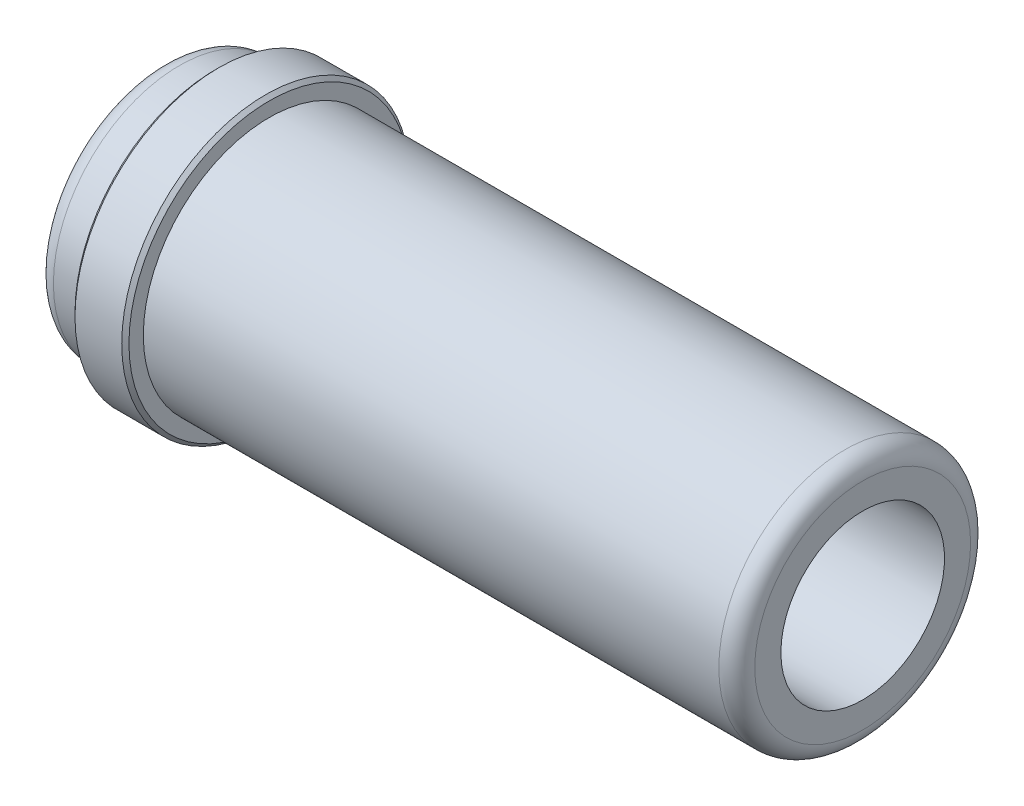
ISO-10303-21;
HEADER;
FILE_DESCRIPTION(('STEP AP214'),'2;1');
FILE_NAME('part.step','',(''),(''),'','','');
FILE_SCHEMA(('AUTOMOTIVE_DESIGN { 1 0 10303 214 1 1 1 1 }'));
ENDSEC;
DATA;
#1=APPLICATION_CONTEXT('core data for automotive mechanical design processes');
#2=APPLICATION_PROTOCOL_DEFINITION('international standard','automotive_design',2000,#1);
#3=PRODUCT_CONTEXT('',#1,'mechanical');
#4=PRODUCT('Part','Part','',(#3));
#5=PRODUCT_RELATED_PRODUCT_CATEGORY('part','',(#4));
#6=PRODUCT_DEFINITION_FORMATION('','',#4);
#7=PRODUCT_DEFINITION_CONTEXT('part definition',#1,'design');
#8=PRODUCT_DEFINITION('design','',#6,#7);
#9=PRODUCT_DEFINITION_SHAPE('','',#8);
#10=(LENGTH_UNIT() NAMED_UNIT(*) SI_UNIT(.MILLI.,.METRE.));
#11=(NAMED_UNIT(*) PLANE_ANGLE_UNIT() SI_UNIT($,.RADIAN.));
#12=(NAMED_UNIT(*) SI_UNIT($,.STERADIAN.) SOLID_ANGLE_UNIT());
#13=UNCERTAINTY_MEASURE_WITH_UNIT(LENGTH_MEASURE(1.E-05),#10,'distance_accuracy_value','');
#14=(GEOMETRIC_REPRESENTATION_CONTEXT(3) GLOBAL_UNCERTAINTY_ASSIGNED_CONTEXT((#13)) GLOBAL_UNIT_ASSIGNED_CONTEXT((#10,
#11,#12)) REPRESENTATION_CONTEXT('',''));
#15=CARTESIAN_POINT('',(0.,0.,0.));
#16=DIRECTION('',(0.,0.,1.));
#17=DIRECTION('',(1.,0.,0.));
#18=AXIS2_PLACEMENT_3D('',#15,#16,#17);
#19=CARTESIAN_POINT('',(3.,7.,0.));
#20=DIRECTION('',(1.,0.,0.));
#21=DIRECTION('',(0.,0.,-1.));
#22=AXIS2_PLACEMENT_3D('',#19,#20,#21);
#23=PLANE('',#22);
#24=CARTESIAN_POINT('',(3.,0.,0.));
#25=DIRECTION('',(1.,0.,0.));
#26=DIRECTION('',(0.,0.,-1.));
#27=AXIS2_PLACEMENT_3D('',#24,#25,#26);
#28=CIRCLE('',#27,7.8);
#29=CARTESIAN_POINT('',(3.,0.,-7.8));
#30=VERTEX_POINT('',#29);
#31=EDGE_CURVE('E9',#30,#30,#28,.F.);
#32=ORIENTED_EDGE('',*,*,#31,.T.);
#33=EDGE_LOOP('',(#32));
#34=FACE_BOUND('',#33,.T.);
#35=CARTESIAN_POINT('',(3.,0.,0.));
#36=DIRECTION('',(-1.,0.,0.));
#37=DIRECTION('',(0.,0.,1.));
#38=AXIS2_PLACEMENT_3D('',#35,#36,#37);
#39=CIRCLE('',#38,7.);
#40=CARTESIAN_POINT('',(3.,0.,7.));
#41=VERTEX_POINT('',#40);
#42=EDGE_CURVE('E55',#41,#41,#39,.T.);
#43=ORIENTED_EDGE('',*,*,#42,.F.);
#44=EDGE_LOOP('',(#43));
#45=FACE_BOUND('',#44,.T.);
#46=ADVANCED_FACE('F14',(#34,#45),#23,.F.);
#47=CARTESIAN_POINT('',(0.,0.,0.));
#48=DIRECTION('',(-1.,0.,0.));
#49=DIRECTION('',(0.,0.,1.));
#50=AXIS2_PLACEMENT_3D('',#47,#48,#49);
#51=CYLINDRICAL_SURFACE('',#50,8.);
#52=CARTESIAN_POINT('',(5.8,0.,0.));
#53=DIRECTION('',(-1.,0.,0.));
#54=DIRECTION('',(0.,0.,1.));
#55=AXIS2_PLACEMENT_3D('',#52,#53,#54);
#56=CIRCLE('',#55,8.);
#57=CARTESIAN_POINT('',(5.8,0.,8.));
#58=VERTEX_POINT('',#57);
#59=EDGE_CURVE('E25',#58,#58,#56,.T.);
#60=ORIENTED_EDGE('',*,*,#59,.T.);
#61=EDGE_LOOP('',(#60));
#62=FACE_BOUND('',#61,.T.);
#63=CARTESIAN_POINT('',(3.2,0.,0.));
#64=DIRECTION('',(1.,0.,0.));
#65=DIRECTION('',(0.,0.,-1.));
#66=AXIS2_PLACEMENT_3D('',#63,#64,#65);
#67=CIRCLE('',#66,8.);
#68=CARTESIAN_POINT('',(3.2,0.,-8.));
#69=VERTEX_POINT('',#68);
#70=EDGE_CURVE('E29',#69,#69,#67,.T.);
#71=ORIENTED_EDGE('',*,*,#70,.T.);
#72=EDGE_LOOP('',(#71));
#73=FACE_BOUND('',#72,.T.);
#74=ADVANCED_FACE('F62',(#62,#73),#51,.T.);
#75=CARTESIAN_POINT('',(6.,8.,0.));
#76=DIRECTION('',(-1.,0.,0.));
#77=DIRECTION('',(0.,0.,1.));
#78=AXIS2_PLACEMENT_3D('',#75,#76,#77);
#79=PLANE('',#78);
#80=CARTESIAN_POINT('',(6.,0.,0.));
#81=DIRECTION('',(-1.,0.,0.));
#82=DIRECTION('',(0.,0.,1.));
#83=AXIS2_PLACEMENT_3D('',#80,#81,#82);
#84=CIRCLE('',#83,7.8);
#85=CARTESIAN_POINT('',(6.,0.,7.8));
#86=VERTEX_POINT('',#85);
#87=EDGE_CURVE('E21',#86,#86,#84,.F.);
#88=ORIENTED_EDGE('',*,*,#87,.T.);
#89=EDGE_LOOP('',(#88));
#90=FACE_BOUND('',#89,.T.);
#91=CARTESIAN_POINT('',(6.,0.,0.));
#92=DIRECTION('',(-1.,0.,0.));
#93=DIRECTION('',(0.,0.,1.));
#94=AXIS2_PLACEMENT_3D('',#91,#92,#93);
#95=CIRCLE('',#94,7.);
#96=CARTESIAN_POINT('',(6.,0.,7.));
#97=VERTEX_POINT('',#96);
#98=EDGE_CURVE('E46',#97,#97,#95,.T.);
#99=ORIENTED_EDGE('',*,*,#98,.T.);
#100=EDGE_LOOP('',(#99));
#101=FACE_BOUND('',#100,.T.);
#102=ADVANCED_FACE('F69',(#90,#101),#79,.F.);
#103=CARTESIAN_POINT('',(0.,0.,0.));
#104=DIRECTION('',(-1.,0.,0.));
#105=DIRECTION('',(0.,0.,1.));
#106=AXIS2_PLACEMENT_3D('',#103,#104,#105);
#107=CYLINDRICAL_SURFACE('',#106,7.);
#108=CARTESIAN_POINT('',(38.,0.,0.));
#109=DIRECTION('',(-1.,0.,0.));
#110=DIRECTION('',(0.,0.,1.));
#111=AXIS2_PLACEMENT_3D('',#108,#109,#110);
#112=CIRCLE('',#111,7.);
#113=CARTESIAN_POINT('',(38.,0.,7.));
#114=VERTEX_POINT('',#113);
#115=EDGE_CURVE('E43',#114,#114,#112,.T.);
#116=ORIENTED_EDGE('',*,*,#115,.T.);
#117=EDGE_LOOP('',(#116));
#118=FACE_BOUND('',#117,.T.);
#119=ORIENTED_EDGE('',*,*,#98,.F.);
#120=EDGE_LOOP('',(#119));
#121=FACE_BOUND('',#120,.T.);
#122=ADVANCED_FACE('F114',(#118,#121),#107,.T.);
#123=CARTESIAN_POINT('',(39.,7.,0.));
#124=DIRECTION('',(-1.,0.,0.));
#125=DIRECTION('',(0.,0.,1.));
#126=AXIS2_PLACEMENT_3D('',#123,#124,#125);
#127=PLANE('',#126);
#128=CARTESIAN_POINT('',(39.,0.,0.));
#129=DIRECTION('',(-1.,0.,0.));
#130=DIRECTION('',(0.,0.,1.));
#131=AXIS2_PLACEMENT_3D('',#128,#129,#130);
#132=CIRCLE('',#131,6.);
#133=CARTESIAN_POINT('',(39.,0.,6.));
#134=VERTEX_POINT('',#133);
#135=EDGE_CURVE('E40',#134,#134,#132,.F.);
#136=ORIENTED_EDGE('',*,*,#135,.T.);
#137=EDGE_LOOP('',(#136));
#138=FACE_BOUND('',#137,.T.);
#139=CARTESIAN_POINT('',(39.,0.,0.));
#140=DIRECTION('',(-1.,0.,0.));
#141=DIRECTION('',(0.,0.,1.));
#142=AXIS2_PLACEMENT_3D('',#139,#140,#141);
#143=CIRCLE('',#142,4.55);
#144=CARTESIAN_POINT('',(39.,0.,4.55));
#145=VERTEX_POINT('',#144);
#146=EDGE_CURVE('E49',#145,#145,#143,.T.);
#147=ORIENTED_EDGE('',*,*,#146,.T.);
#148=EDGE_LOOP('',(#147));
#149=FACE_BOUND('',#148,.T.);
#150=ADVANCED_FACE('F144',(#138,#149),#127,.F.);
#151=CARTESIAN_POINT('',(0.,0.,0.));
#152=DIRECTION('',(-1.,0.,0.));
#153=DIRECTION('',(0.,0.,1.));
#154=AXIS2_PLACEMENT_3D('',#151,#152,#153);
#155=CYLINDRICAL_SURFACE('',#154,4.55);
#156=ORIENTED_EDGE('',*,*,#146,.F.);
#157=EDGE_LOOP('',(#156));
#158=FACE_BOUND('',#157,.T.);
#159=CARTESIAN_POINT('',(0.,0.,0.));
#160=DIRECTION('',(-1.,0.,0.));
#161=DIRECTION('',(0.,0.,1.));
#162=AXIS2_PLACEMENT_3D('',#159,#160,#161);
#163=CIRCLE('',#162,4.55);
#164=CARTESIAN_POINT('',(0.,0.,4.55));
#165=VERTEX_POINT('',#164);
#166=EDGE_CURVE('E52',#165,#165,#163,.T.);
#167=ORIENTED_EDGE('',*,*,#166,.T.);
#168=EDGE_LOOP('',(#167));
#169=FACE_BOUND('',#168,.T.);
#170=ADVANCED_FACE('F136',(#158,#169),#155,.F.);
#171=CARTESIAN_POINT('',(0.,4.55,0.));
#172=DIRECTION('',(1.,0.,0.));
#173=DIRECTION('',(0.,0.,-1.));
#174=AXIS2_PLACEMENT_3D('',#171,#172,#173);
#175=PLANE('',#174);
#176=CARTESIAN_POINT('',(0.,0.,0.));
#177=DIRECTION('',(1.,0.,0.));
#178=DIRECTION('',(0.,0.,-1.));
#179=AXIS2_PLACEMENT_3D('',#176,#177,#178);
#180=CIRCLE('',#179,6.);
#181=CARTESIAN_POINT('',(0.,0.,-6.));
#182=VERTEX_POINT('',#181);
#183=EDGE_CURVE('E37',#182,#182,#180,.F.);
#184=ORIENTED_EDGE('',*,*,#183,.T.);
#185=EDGE_LOOP('',(#184));
#186=FACE_BOUND('',#185,.T.);
#187=ORIENTED_EDGE('',*,*,#166,.F.);
#188=EDGE_LOOP('',(#187));
#189=FACE_BOUND('',#188,.T.);
#190=ADVANCED_FACE('F125',(#186,#189),#175,.F.);
#191=CARTESIAN_POINT('',(0.,0.,0.));
#192=DIRECTION('',(-1.,0.,0.));
#193=DIRECTION('',(0.,0.,1.));
#194=AXIS2_PLACEMENT_3D('',#191,#192,#193);
#195=CYLINDRICAL_SURFACE('',#194,7.);
#196=CARTESIAN_POINT('',(1.,0.,0.));
#197=DIRECTION('',(1.,0.,0.));
#198=DIRECTION('',(0.,0.,-1.));
#199=AXIS2_PLACEMENT_3D('',#196,#197,#198);
#200=CIRCLE('',#199,7.);
#201=CARTESIAN_POINT('',(1.,0.,-7.));
#202=VERTEX_POINT('',#201);
#203=EDGE_CURVE('E34',#202,#202,#200,.T.);
#204=ORIENTED_EDGE('',*,*,#203,.T.);
#205=EDGE_LOOP('',(#204));
#206=FACE_BOUND('',#205,.T.);
#207=ORIENTED_EDGE('',*,*,#42,.T.);
#208=EDGE_LOOP('',(#207));
#209=FACE_BOUND('',#208,.T.);
#210=ADVANCED_FACE('F59',(#206,#209),#195,.T.);
#211=CARTESIAN_POINT('',(38.,0.,0.));
#212=DIRECTION('',(-1.,0.,0.));
#213=DIRECTION('',(0.,0.,1.));
#214=AXIS2_PLACEMENT_3D('',#211,#212,#213);
#215=TOROIDAL_SURFACE('',#214,6.,1.);
#216=ORIENTED_EDGE('',*,*,#135,.F.);
#217=EDGE_LOOP('',(#216));
#218=FACE_BOUND('',#217,.T.);
#219=ORIENTED_EDGE('',*,*,#115,.F.);
#220=EDGE_LOOP('',(#219));
#221=FACE_BOUND('',#220,.T.);
#222=ADVANCED_FACE('F74',(#218,#221),#215,.T.);
#223=CARTESIAN_POINT('',(1.,0.,0.));
#224=DIRECTION('',(1.,0.,0.));
#225=DIRECTION('',(0.,0.,-1.));
#226=AXIS2_PLACEMENT_3D('',#223,#224,#225);
#227=TOROIDAL_SURFACE('',#226,6.,1.);
#228=ORIENTED_EDGE('',*,*,#203,.F.);
#229=EDGE_LOOP('',(#228));
#230=FACE_BOUND('',#229,.T.);
#231=ORIENTED_EDGE('',*,*,#183,.F.);
#232=EDGE_LOOP('',(#231));
#233=FACE_BOUND('',#232,.T.);
#234=ADVANCED_FACE('F77',(#230,#233),#227,.T.);
#235=CARTESIAN_POINT('',(5.8,0.,0.));
#236=DIRECTION('',(-1.,0.,0.));
#237=DIRECTION('',(0.,0.,1.));
#238=AXIS2_PLACEMENT_3D('',#235,#236,#237);
#239=CONICAL_SURFACE('',#238,8.,0.785398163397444);
#240=ORIENTED_EDGE('',*,*,#87,.F.);
#241=EDGE_LOOP('',(#240));
#242=FACE_BOUND('',#241,.T.);
#243=ORIENTED_EDGE('',*,*,#59,.F.);
#244=EDGE_LOOP('',(#243));
#245=FACE_BOUND('',#244,.T.);
#246=ADVANCED_FACE('F80',(#242,#245),#239,.T.);
#247=CARTESIAN_POINT('',(3.,0.,0.));
#248=DIRECTION('',(1.,0.,0.));
#249=DIRECTION('',(0.,0.,-1.));
#250=AXIS2_PLACEMENT_3D('',#247,#248,#249);
#251=CONICAL_SURFACE('',#250,7.8,0.785398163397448);
#252=ORIENTED_EDGE('',*,*,#70,.F.);
#253=EDGE_LOOP('',(#252));
#254=FACE_BOUND('',#253,.T.);
#255=ORIENTED_EDGE('',*,*,#31,.F.);
#256=EDGE_LOOP('',(#255));
#257=FACE_BOUND('',#256,.T.);
#258=ADVANCED_FACE('F16',(#254,#257),#251,.T.);
#259=CLOSED_SHELL('',(#46,#74,#102,#122,#150,#170,#190,#210,#222,#234,#246,#258));
#260=MANIFOLD_SOLID_BREP('B1',#259);
#261=ADVANCED_BREP_SHAPE_REPRESENTATION('',(#18,#260),#14);
#262=SHAPE_DEFINITION_REPRESENTATION(#9,#261);
ENDSEC;
END-ISO-10303-21;
